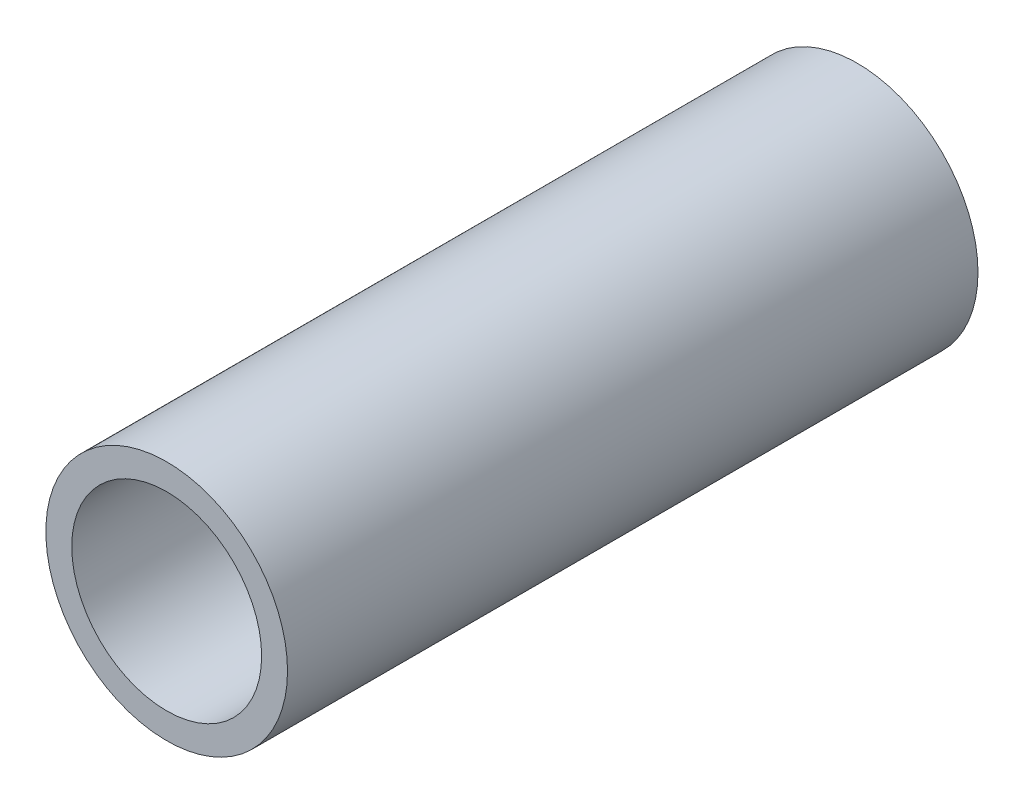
from build123d import *

# Parameters (mm, degrees)
ESQUISSE1_R      = 14
ESQUISSE1_R_2    = 11
EXTRUSION1_DEPTH = 80


with BuildPart() as part:
    # Esquisse1 → Extrusion1 (new body)
    with BuildSketch(Plane.XY):
        Circle(ESQUISSE1_R)
        Circle(ESQUISSE1_R_2, mode=Mode.SUBTRACT)
    extrude(amount=EXTRUSION1_DEPTH)


solid = part.part
